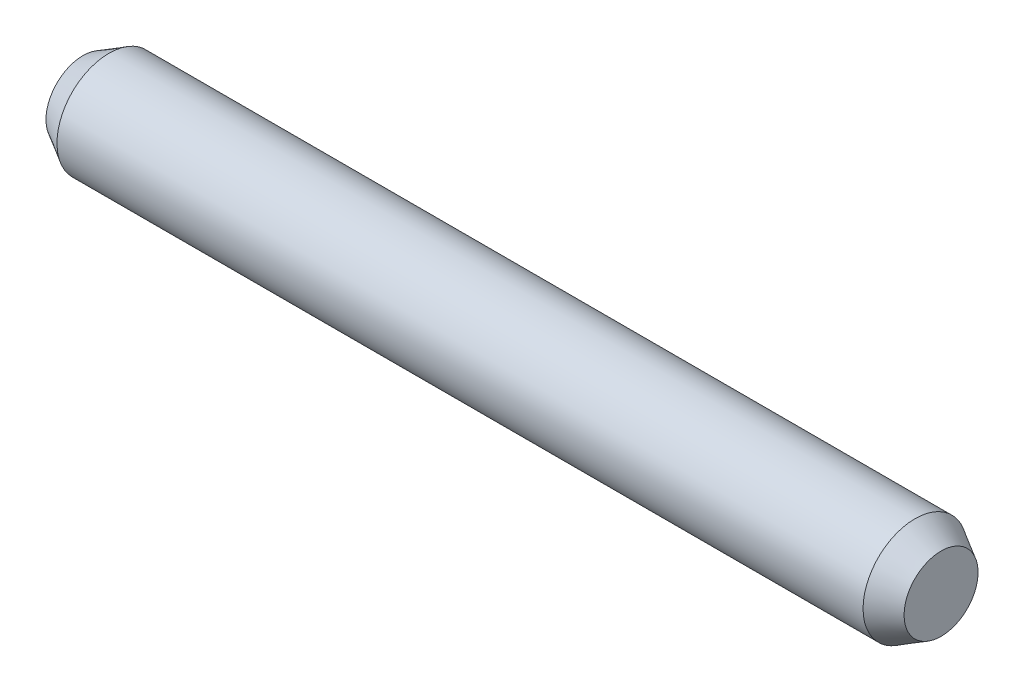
ISO-10303-21;
HEADER;
FILE_DESCRIPTION(('STEP AP214'),'2;1');
FILE_NAME('part.step','',(''),(''),'','','');
FILE_SCHEMA(('AUTOMOTIVE_DESIGN { 1 0 10303 214 1 1 1 1 }'));
ENDSEC;
DATA;
#1=APPLICATION_CONTEXT('core data for automotive mechanical design processes');
#2=APPLICATION_PROTOCOL_DEFINITION('international standard','automotive_design',2000,#1);
#3=PRODUCT_CONTEXT('',#1,'mechanical');
#4=PRODUCT('Part','Part','',(#3));
#5=PRODUCT_RELATED_PRODUCT_CATEGORY('part','',(#4));
#6=PRODUCT_DEFINITION_FORMATION('','',#4);
#7=PRODUCT_DEFINITION_CONTEXT('part definition',#1,'design');
#8=PRODUCT_DEFINITION('design','',#6,#7);
#9=PRODUCT_DEFINITION_SHAPE('','',#8);
#10=(LENGTH_UNIT() NAMED_UNIT(*) SI_UNIT(.MILLI.,.METRE.));
#11=(NAMED_UNIT(*) PLANE_ANGLE_UNIT() SI_UNIT($,.RADIAN.));
#12=(NAMED_UNIT(*) SI_UNIT($,.STERADIAN.) SOLID_ANGLE_UNIT());
#13=UNCERTAINTY_MEASURE_WITH_UNIT(LENGTH_MEASURE(1.E-05),#10,'distance_accuracy_value','');
#14=(GEOMETRIC_REPRESENTATION_CONTEXT(3) GLOBAL_UNCERTAINTY_ASSIGNED_CONTEXT((#13)) GLOBAL_UNIT_ASSIGNED_CONTEXT((#10,
#11,#12)) REPRESENTATION_CONTEXT('',''));
#15=CARTESIAN_POINT('',(0.,0.,0.));
#16=DIRECTION('',(0.,0.,1.));
#17=DIRECTION('',(1.,0.,0.));
#18=AXIS2_PLACEMENT_3D('',#15,#16,#17);
#19=CARTESIAN_POINT('',(-11.05,15.540380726,-26.608597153));
#20=DIRECTION('',(1.,0.,0.));
#21=DIRECTION('',(0.,0.,-1.));
#22=AXIS2_PLACEMENT_3D('',#19,#20,#21);
#23=PLANE('',#22);
#24=CARTESIAN_POINT('',(-11.05,16.26024149,-27.328457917));
#25=DIRECTION('',(-1.,0.,0.));
#26=DIRECTION('',(0.,0.,1.));
#27=AXIS2_PLACEMENT_3D('',#24,#25,#26);
#28=CIRCLE('',#27,0.711324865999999);
#29=CARTESIAN_POINT('',(-11.05,16.26024149,-26.617133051));
#30=VERTEX_POINT('',#29);
#31=EDGE_CURVE('E19',#30,#30,#28,.F.);
#32=ORIENTED_EDGE('',*,*,#31,.T.);
#33=EDGE_LOOP('',(#32));
#34=FACE_BOUND('',#33,.T.);
#35=ADVANCED_FACE('F15',(#34),#23,.T.);
#36=CARTESIAN_POINT('',(-11.05,16.26024149,-27.328457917));
#37=DIRECTION('',(-1.,0.,0.));
#38=DIRECTION('',(0.,0.,1.));
#39=AXIS2_PLACEMENT_3D('',#36,#37,#38);
#40=CONICAL_SURFACE('',#39,0.711324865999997,0.52359877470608);
#41=CARTESIAN_POINT('',(-11.55,16.26024149,-27.328457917));
#42=DIRECTION('',(1.,0.,0.));
#43=DIRECTION('',(0.,0.,-1.));
#44=AXIS2_PLACEMENT_3D('',#41,#42,#43);
#45=CIRCLE('',#44,1.);
#46=CARTESIAN_POINT('',(-11.55,16.26024149,-28.328457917));
#47=VERTEX_POINT('',#46);
#48=EDGE_CURVE('E27',#47,#47,#45,.T.);
#49=ORIENTED_EDGE('',*,*,#48,.T.);
#50=EDGE_LOOP('',(#49));
#51=FACE_BOUND('',#50,.T.);
#52=ORIENTED_EDGE('',*,*,#31,.F.);
#53=EDGE_LOOP('',(#52));
#54=FACE_BOUND('',#53,.T.);
#55=ADVANCED_FACE('F37',(#51,#54),#40,.T.);
#56=CARTESIAN_POINT('',(-27.05,16.26024149,-27.328457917));
#57=DIRECTION('',(1.,0.,0.));
#58=DIRECTION('',(0.,1.,0.));
#59=AXIS2_PLACEMENT_3D('',#56,#57,#58);
#60=CYLINDRICAL_SURFACE('',#59,1.);
#61=ORIENTED_EDGE('',*,*,#48,.F.);
#62=EDGE_LOOP('',(#61));
#63=FACE_BOUND('',#62,.T.);
#64=CARTESIAN_POINT('',(-27.05,16.26024149,-27.328457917));
#65=DIRECTION('',(1.,0.,0.));
#66=DIRECTION('',(0.,0.,-1.));
#67=AXIS2_PLACEMENT_3D('',#64,#65,#66);
#68=CIRCLE('',#67,1.);
#69=CARTESIAN_POINT('',(-27.05,16.26024149,-28.328457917));
#70=VERTEX_POINT('',#69);
#71=EDGE_CURVE('E23',#70,#70,#68,.T.);
#72=ORIENTED_EDGE('',*,*,#71,.T.);
#73=EDGE_LOOP('',(#72));
#74=FACE_BOUND('',#73,.T.);
#75=ADVANCED_FACE('F39',(#63,#74),#60,.T.);
#76=CARTESIAN_POINT('',(-27.55,15.540380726,-26.608597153));
#77=DIRECTION('',(1.,0.,0.));
#78=DIRECTION('',(0.,0.,-1.));
#79=AXIS2_PLACEMENT_3D('',#76,#77,#78);
#80=PLANE('',#79);
#81=CARTESIAN_POINT('',(-27.55,16.26024149,-27.328457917));
#82=DIRECTION('',(1.,0.,0.));
#83=DIRECTION('',(0.,1.,0.));
#84=AXIS2_PLACEMENT_3D('',#81,#82,#83);
#85=CIRCLE('',#84,0.71132486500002);
#86=CARTESIAN_POINT('',(-27.55,16.971566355,-27.328457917));
#87=VERTEX_POINT('',#86);
#88=EDGE_CURVE('E10',#87,#87,#85,.F.);
#89=ORIENTED_EDGE('',*,*,#88,.T.);
#90=EDGE_LOOP('',(#89));
#91=FACE_BOUND('',#90,.T.);
#92=ADVANCED_FACE('F17',(#91),#80,.F.);
#93=CARTESIAN_POINT('',(-27.55,16.26024149,-27.328457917));
#94=DIRECTION('',(1.,0.,0.));
#95=DIRECTION('',(0.,1.,0.));
#96=AXIS2_PLACEMENT_3D('',#93,#94,#95);
#97=CONICAL_SURFACE('',#96,0.711324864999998,0.523598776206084);
#98=ORIENTED_EDGE('',*,*,#88,.F.);
#99=EDGE_LOOP('',(#98));
#100=FACE_BOUND('',#99,.T.);
#101=ORIENTED_EDGE('',*,*,#71,.F.);
#102=EDGE_LOOP('',(#101));
#103=FACE_BOUND('',#102,.T.);
#104=ADVANCED_FACE('F48',(#100,#103),#97,.T.);
#105=CLOSED_SHELL('',(#35,#55,#75,#92,#104));
#106=MANIFOLD_SOLID_BREP('B1',#105);
#107=ADVANCED_BREP_SHAPE_REPRESENTATION('',(#18,#106),#14);
#108=SHAPE_DEFINITION_REPRESENTATION(#9,#107);
ENDSEC;
END-ISO-10303-21;
